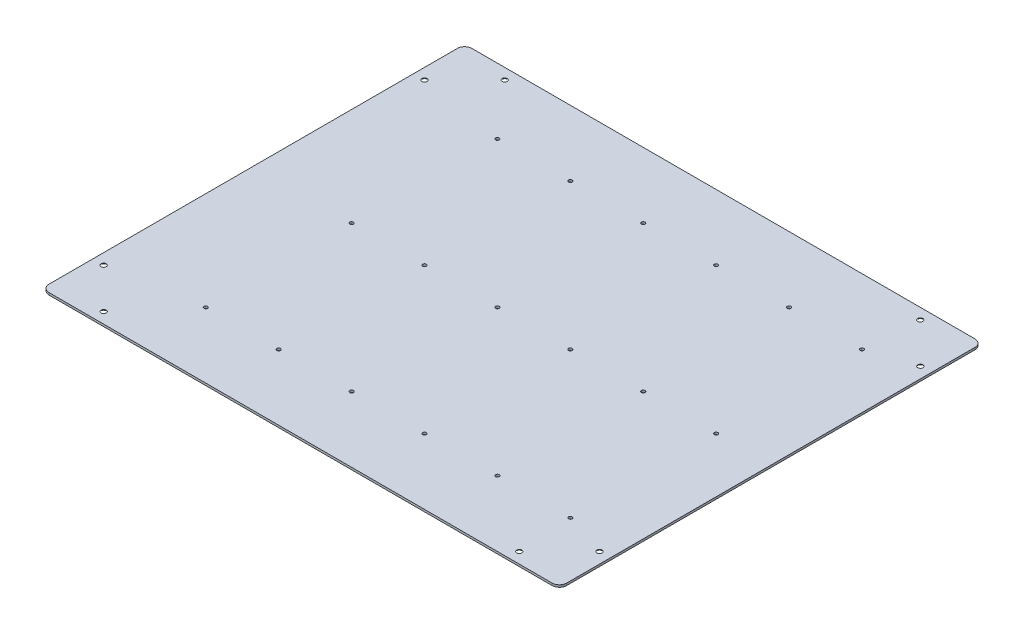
from build123d import *

# Parameters (mm, degrees)
SKETCH_1_W                  = 710
SKETCH_1_H                  = 580
EXTRUDE_1_DEPTH             = 3
HOLE_WIZARD_M6_1_AT_2_COUNT = 2
HOLE_WIZARD_M6_1_AT_2_PITCH = 77.781745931
HOLE_WIZARD_M6_1_AT_3_COUNT = 2
HOLE_WIZARD_M6_1_AT_3_PITCH = 498.046182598
HOLE_WIZARD_M6_1_AT_4_COUNT = 2
HOLE_WIZARD_M6_1_AT_4_PITCH = 550
HOLE_WIZARD_M6_1_AT_5_COUNT = 2
HOLE_WIZARD_M6_1_AT_5_PITCH = 792.085853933
HOLE_WIZARD_M6_1_AT_6_COUNT = 2
HOLE_WIZARD_M6_1_AT_6_PITCH = 797.276614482
HOLE_WIZARD_M6_1_AT_7_COUNT = 2
HOLE_WIZARD_M6_1_AT_7_PITCH = 627.415332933
HOLE_WIZARD_M6_1_AT_8_COUNT = 2
HOLE_WIZARD_M6_1_AT_8_PITCH = 570
HOLE_WIZARD_M6_1_2_D        = 5
PATTERN_LINEAR_1_COUNT      = 3
PATTERN_LINEAR_1_PITCH      = 200
PATTERN_LINEAR_1_COUNT_DIR2 = 6
PATTERN_LINEAR_1_PITCH_DIR2 = 100
FILLET_1_R                  = 10


with BuildPart() as part:
    # Sketch 1 → Extrude 1 (new body)
    with BuildSketch(Plane(origin=(0, 0, 0), x_dir=(1, 0, 0), z_dir=(0, 1, 0))):
        Rectangle(SKETCH_1_W, SKETCH_1_H)
    extrude(amount=EXTRUDE_1_DEPTH)

    # Sketch 5 → Hole Wizard M6 _1 (revolve, cut)
    with BuildSketch(Plane(origin=(285, 0, -275), x_dir=(0, 0, -1), z_dir=(1, 0, 0))):
        Polygon((0, 0), (0, 3), (3.5, 3), (3.5, 2.9), (6.4, 0), align=None)
    hole_wizard_m6_1 = revolve(axis=Axis((285, -6.35, -275), (0, 1, 0)), mode=Mode.SUBTRACT)

    # Hole Wizard M6 _1 at 2: Hole Wizard M6 _1 ×2
    with Locations(*[Vector(0.7071067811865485, 0, 0.7071067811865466) * (i * HOLE_WIZARD_M6_1_AT_2_PITCH) for i in range(1, HOLE_WIZARD_M6_1_AT_2_COUNT)]):
        add(hole_wizard_m6_1, mode=Mode.SUBTRACT)

    # Hole Wizard M6 _1 at 3: Hole Wizard M6 _1 ×2
    with Locations(*[Vector(0.11043152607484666, 0, 0.9938837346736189) * (i * HOLE_WIZARD_M6_1_AT_3_PITCH) for i in range(1, HOLE_WIZARD_M6_1_AT_3_COUNT)]):
        add(hole_wizard_m6_1, mode=Mode.SUBTRACT)

    # Hole Wizard M6 _1 at 4: Hole Wizard M6 _1 ×2
    with Locations(*[(0, 0, i * HOLE_WIZARD_M6_1_AT_4_PITCH) for i in range(1, HOLE_WIZARD_M6_1_AT_4_COUNT)]):
        add(hole_wizard_m6_1, mode=Mode.SUBTRACT)

    # Hole Wizard M6 _1 at 5: Hole Wizard M6 _1 ×2
    with Locations(*[Vector(-0.7196189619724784, 0, 0.6943691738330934) * (i * HOLE_WIZARD_M6_1_AT_5_PITCH) for i in range(1, HOLE_WIZARD_M6_1_AT_5_COUNT)]):
        add(hole_wizard_m6_1, mode=Mode.SUBTRACT)

    # Hole Wizard M6 _1 at 6: Hole Wizard M6 _1 ×2
    with Locations(*[Vector(-0.7839186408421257, 0, 0.6208635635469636) * (i * HOLE_WIZARD_M6_1_AT_6_PITCH) for i in range(1, HOLE_WIZARD_M6_1_AT_6_COUNT)]):
        add(hole_wizard_m6_1, mode=Mode.SUBTRACT)

    # Hole Wizard M6 _1 at 7: Hole Wizard M6 _1 ×2
    with Locations(*[Vector(-0.9961503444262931, 0, 0.08766123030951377) * (i * HOLE_WIZARD_M6_1_AT_7_PITCH) for i in range(1, HOLE_WIZARD_M6_1_AT_7_COUNT)]):
        add(hole_wizard_m6_1, mode=Mode.SUBTRACT)

    # Hole Wizard M6 _1 at 8: Hole Wizard M6 _1 ×2
    with Locations(*[(-i * HOLE_WIZARD_M6_1_AT_8_PITCH, 0, 0) for i in range(1, HOLE_WIZARD_M6_1_AT_8_COUNT)]):
        add(hole_wizard_m6_1, mode=Mode.SUBTRACT)

    # Hole Wizard M6 _1 2 (through all)
    with Locations(Plane(origin=(0, 3, 0), x_dir=(1, 0, 0), z_dir=(0, 1, 0))):
        with Locations((-220, -200)):
            hole_wizard_m6_1_2 = Hole(HOLE_WIZARD_M6_1_2_D / 2)

    # Pattern Linear 1: Hole Wizard M6 _1 2 3 × 6
    with Locations(*[(j * PATTERN_LINEAR_1_PITCH_DIR2, 0, -i * PATTERN_LINEAR_1_PITCH) for i in range(PATTERN_LINEAR_1_COUNT) for j in range(PATTERN_LINEAR_1_COUNT_DIR2) if (i, j) != (0, 0)]):
        add(hole_wizard_m6_1_2, mode=Mode.SUBTRACT)

    # Fillet 1
    fillet_1_edges = [part.edges().sort_by_distance(p)[0] for p in [
        (355, 1.5, 290),
        (-355, 1.5, 290),
        (-355, 1.5, -290),
        (355, 1.5, -290),
    ]]
    fillet(fillet_1_edges, radius=FILLET_1_R)


solid = part.part
